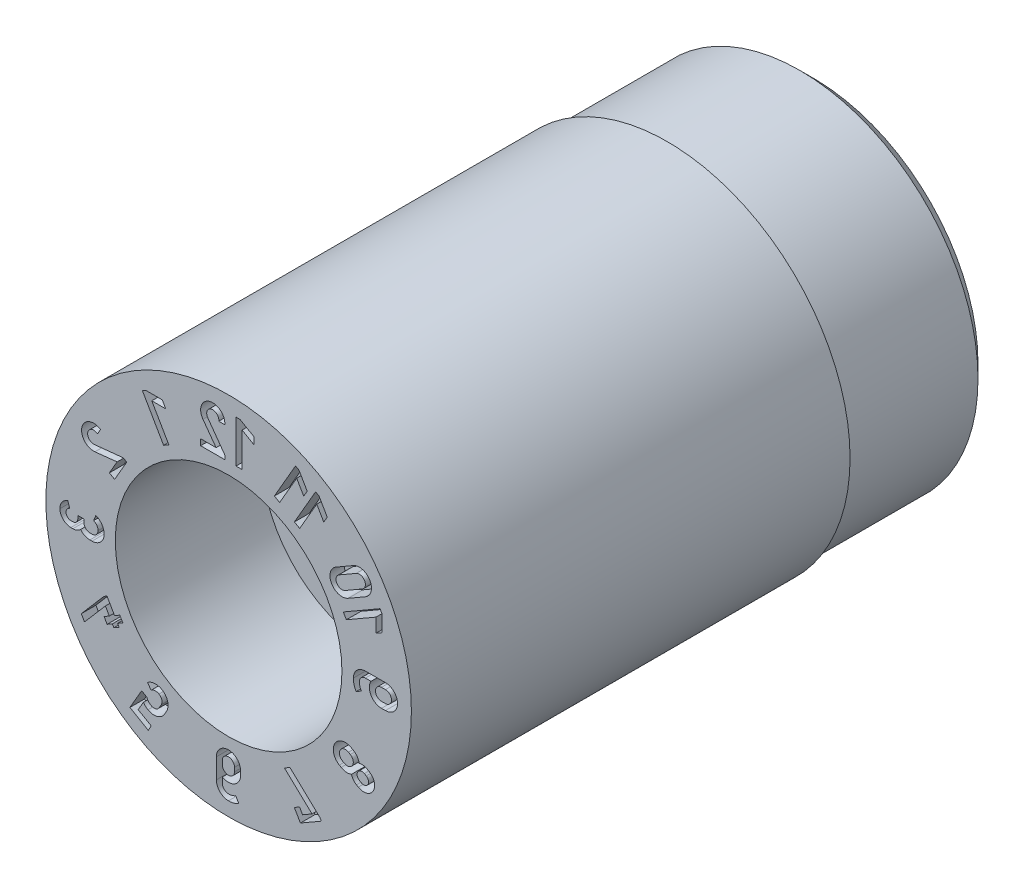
from build123d import *

# Parameters (mm, degrees)
SKETCH4_W          = 2
SKETCH4_H          = 1
CUT_EXTRUDE1_DEPTH = 0.2


with BuildPart() as part:
    # Sketch1 → Revolve1 (revolve)
    with BuildSketch(Plane(origin=(0, 0, 0), x_dir=(0, 0, -1), z_dir=(1, 0, 0)), mode=Mode.PRIVATE) as revolve1_sk:
        Polygon((0, 2.5), (0, 1.55), (2, 1.55), (2, 0.8), (8, 0.8), (8, 2.25), (7.75, 2.5), align=None)
    revolve(revolve1_sk.sketch.rotate(Axis((0, 0, 3.797909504), (0, 0, -1)), 90), axis=Axis((0, 0, 3.797909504), (0, 0, -1)))

    # Sketch4 → Cut-Revolve1 (revolve, cut)
    with BuildSketch(Plane(origin=(0, 0, 0), x_dir=(0, 0, -1), z_dir=(1, 0, 0)), mode=Mode.PRIVATE) as cut_revolve1_sk:
        with Locations((7, 2.935)):
            Rectangle(SKETCH4_W, SKETCH4_H)
    revolve(cut_revolve1_sk.sketch.rotate(Axis((0, 0, 0), (0, 0, -1)), 90), axis=Axis((0, 0, 0), (0, 0, -1)), mode=Mode.SUBTRACT)

    # Sketch2 → Cut-Extrude1 (cut)
    # profile 1 of 15: a face of its own
    with BuildSketch(Plane.XY):
        Polygon((1.189785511, 1.946416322), (1.236985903, 1.919165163), (1.349145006, 1.725678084), (1.30140042, 1.642982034), (1.205586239, 1.80821378), (0.97169688, 1.403105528), (0.900002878, 1.444498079), align=None)
    # profile 2 of 15: a face of its own
    with BuildSketch(Plane.XY):
        Polygon((0.915385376, 2.116117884), (0.962585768, 2.088866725), (1.074744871, 1.895379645), (1.027000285, 1.812683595), (0.931186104, 1.977915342), (0.697296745, 1.572807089), (0.625602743, 1.61419964), align=None)
    # profile 3 of 15: a face of its own
    with BuildSketch(Plane.XY):
        with BuildLine():
            Line((2.144767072, 0.163392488), (1.871541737, 0.163346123))
            ThreePointArc((1.871541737, 0.163346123), (1.754462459, 0.114843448), (1.705943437, -0.002229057))
            ThreePointArc((1.705943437, -0.002229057), (1.715873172, -0.075274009), (1.744983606, -0.142999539))
            Line((1.744983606, -0.142999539), (1.816077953, -0.100273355))
            ThreePointArc((1.816077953, -0.100273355), (1.793827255, -0.050339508), (1.7889851, 0.004112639))
            ThreePointArc((1.7889851, 0.004112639), (1.815273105, 0.058513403), (1.871527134, 0.080558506))
            Line((1.871527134, 0.080558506), (1.947523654, 0.080551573))
            ThreePointArc((1.947523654, 0.080551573), (1.94718892, -0.085293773), (2.090950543, -0.167982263))
            Line((2.090950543, -0.167982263), (2.144654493, -0.167796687))
            ThreePointArc((2.144654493, -0.167796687), (2.31030537, -0.002258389), (2.144767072, 0.163392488))
        make_face()
        with BuildLine():
            Line((2.144767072, 0.080561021), (2.090960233, 0.080561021))
            ThreePointArc((2.090960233, 0.080561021), (2.00816354, -0.002238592), (2.090966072, -0.085032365))
            Line((2.090966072, -0.085032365), (2.144761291, -0.085032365))
            ThreePointArc((2.144761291, -0.085032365), (2.227560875, -0.002238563), (2.144767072, 0.080561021))
        make_face(mode=Mode.SUBTRACT)
    # profile 4 of 15: a face of its own
    with BuildSketch(Plane.XY):
        Polygon((0.763515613, -1.538242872), (0.838361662, -1.495030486), (1.248532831, -1.881560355), (1.268400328, -1.91597187), (0.981584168, -2.081565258), (0.898787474, -1.938157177), (0.970501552, -1.896753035), (1.011894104, -1.968447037), (1.140947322, -1.893938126), align=None)
    # profile 5 of 15: a face of its own
    with BuildSketch(Plane.XY):
        with BuildLine():
            Line((1.705307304, -0.85661671), (1.680233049, -0.842113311))
            ThreePointArc((1.680233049, -0.842113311), (1.45391345, -0.902658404), (1.514639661, -1.128929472))
            Line((1.514639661, -1.128929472), (1.539717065, -1.143407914))
            ThreePointArc((1.539717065, -1.143407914), (1.608311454, -1.164983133), (1.679583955, -1.155448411))
            ThreePointArc((1.679583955, -1.155448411), (1.705355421, -1.207044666), (1.748767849, -1.24501443))
            Line((1.748767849, -1.24501443), (1.773870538, -1.259483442))
            ThreePointArc((1.773870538, -1.259483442), (1.977393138, -1.20494098), (1.922850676, -1.00141838))
            Line((1.922850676, -1.00141838), (1.897809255, -0.986853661))
            ThreePointArc((1.897809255, -0.986853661), (1.843247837, -0.968135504), (1.785676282, -0.971717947))
            ThreePointArc((1.785676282, -0.971717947), (1.758292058, -0.905229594), (1.705307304, -0.85661671))
        make_face()
        with BuildLine():
            Line((1.790155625, -1.173326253), (1.81525798, -1.187792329))
            ThreePointArc((1.81525798, -1.187792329), (1.905733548, -1.163549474), (1.881490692, -1.073073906))
            Line((1.881490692, -1.073073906), (1.856411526, -1.058567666))
            ThreePointArc((1.856411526, -1.058567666), (1.765812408, -1.082765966), (1.790155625, -1.173326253))
        make_face(mode=Mode.SUBTRACT)
        with BuildLine():
            Line((1.55601773, -1.057232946), (1.581132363, -1.071732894))
            ThreePointArc((1.581132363, -1.071732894), (1.694215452, -1.04141854), (1.663901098, -0.928335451))
            Line((1.663901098, -0.928335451), (1.638826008, -0.913804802))
            ThreePointArc((1.638826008, -0.913804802), (1.525737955, -0.944132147), (1.55601773, -1.057232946))
        make_face(mode=Mode.SUBTRACT)
    # profile 6 of 15: a face of its own
    with BuildSketch(Plane.XY):
        Polygon((2.071005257, 1.002372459), (2.098256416, 0.955172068), (2.098645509, 0.73152779), (2.015949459, 0.683783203), (2.015587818, 0.874785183), (1.610479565, 0.640895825), (1.569087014, 0.712589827), align=None)
    # profile 7 of 15: a face of its own
    with BuildSketch(Plane.XY):
        with BuildLine():
            Line((1.705388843, 1.33047051), (1.468770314, 1.193858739))
            ThreePointArc((1.468770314, 1.193858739), (1.408137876, 0.967618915), (1.634381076, 0.906999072))
            Line((1.634381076, 0.906999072), (1.871005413, 1.043614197))
            ThreePointArc((1.871005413, 1.043614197), (1.931625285, 1.269850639), (1.705388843, 1.33047051))
        make_face()
        with BuildLine():
            Line((1.592976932, 0.978713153), (1.829601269, 1.115328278))
            ThreePointArc((1.829601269, 1.115328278), (1.85990272, 1.228414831), (1.746816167, 1.258716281))
            Line((1.746816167, 1.258716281), (1.510163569, 1.122138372))
            ThreePointArc((1.510163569, 1.122138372), (1.4798551, 1.009017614), (1.592976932, 0.978713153))
        make_face(mode=Mode.SUBTRACT)
    # profile 8 of 15: a face of its own
    with BuildSketch(Plane.XY):
        Polygon((0.101613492, 2.286608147), (0.156115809, 2.286608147), (0.349991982, 2.175122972), (0.349991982, 2.079633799), (0.184398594, 2.174821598), (0.184398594, 1.707042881), (0.101613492, 1.707042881), align=None)
    # profile 9 of 15: a face of its own
    with BuildSketch(Plane.XY):
        with BuildLine():
            Line((-0.382458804, 1.705773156), (-0.051272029, 1.705773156))
            Line((-0.051272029, 1.705773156), (-0.051272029, 1.760530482))
            Line((-0.051272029, 1.760530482), (-0.284094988, 2.083765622))
            ThreePointArc((-0.284094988, 2.083765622), (-0.236321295, 2.212681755), (-0.135007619, 2.119745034))
            Line((-0.135007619, 2.119745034), (-0.05173191, 2.119742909))
            ThreePointArc((-0.05173191, 2.119742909), (-0.261870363, 2.291530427), (-0.35138769, 2.03529661))
            Line((-0.35138769, 2.03529661), (-0.171311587, 1.788581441))
            Line((-0.171311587, 1.788581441), (-0.382458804, 1.788581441))
            Line((-0.382458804, 1.788581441), (-0.382458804, 1.705773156))
        make_face()
    # profile 10 of 15: a face of its own
    with BuildSketch(Plane.XY):
        Polygon((-1.178901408, 1.959132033), (-1.131701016, 1.986383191), (-0.908056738, 1.986772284), (-0.860312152, 1.904076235), (-1.051314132, 1.903714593), (-0.817424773, 1.498606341), (-0.889118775, 1.457213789), align=None)
    # profile 11 of 15: a face of its own
    with BuildSketch(Plane.XY):
        with BuildLine():
            Line((0.163306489, -1.871711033), (0.163492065, -1.925414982))
            ThreePointArc((0.163492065, -1.925414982), (0.080803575, -2.069176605), (-0.085041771, -2.068841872))
            Line((-0.085041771, -2.068841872), (-0.085048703, -2.144838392))
            ThreePointArc((-0.085048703, -2.144838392), (-0.0630036, -2.201092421), (-0.008602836, -2.227380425))
            ThreePointArc((-0.008602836, -2.227380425), (0.045845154, -2.222539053), (0.09577566, -2.200291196))
            Line((0.09577566, -2.200291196), (0.138511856, -2.271391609))
            ThreePointArc((0.138511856, -2.271391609), (0.070786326, -2.300502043), (-0.002258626, -2.310431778))
            ThreePointArc((-0.002258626, -2.310431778), (-0.11933113, -2.261912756), (-0.167833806, -2.144833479))
            Line((-0.167833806, -2.144833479), (-0.167880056, -1.871597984))
            ThreePointArc((-0.167880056, -1.871597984), (-0.002230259, -1.706061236), (0.163306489, -1.871711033))
        make_face()
        with BuildLine():
            Line((-0.085048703, -1.871608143), (-0.085048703, -1.925414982))
            ThreePointArc((-0.085048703, -1.925414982), (-0.002249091, -2.008211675), (0.080544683, -1.925409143))
            Line((0.080544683, -1.925409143), (0.080544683, -1.871613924))
            ThreePointArc((0.080544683, -1.871613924), (-0.00224912, -1.788814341), (-0.085048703, -1.871608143))
        make_face(mode=Mode.SUBTRACT)
    # profile 12 of 15: a face of its own
    with BuildSketch(Plane.XY):
        with BuildLine():
            Line((-0.850418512, -1.674551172), (-0.877373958, -1.721100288))
            ThreePointArc((-0.877373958, -1.721100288), (-0.977919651, -1.798165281), (-1.103534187, -1.781750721))
            ThreePointArc((-1.103534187, -1.781750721), (-1.137985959, -1.756862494), (-1.166573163, -1.725412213))
            Line((-1.166573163, -1.725412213), (-1.237312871, -1.847914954))
            Line((-1.237312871, -1.847914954), (-1.058047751, -1.951413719))
            Line((-1.058047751, -1.951413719), (-1.099451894, -2.023127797))
            Line((-1.099451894, -2.023127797), (-1.350411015, -1.878236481))
            Line((-1.350411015, -1.878236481), (-1.189709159, -1.5998927))
            Line((-1.189709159, -1.5998927), (-1.118015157, -1.641285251))
            ThreePointArc((-1.118015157, -1.641285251), (-1.09640669, -1.680826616), (-1.062121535, -1.710066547))
            ThreePointArc((-1.062121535, -1.710066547), (-0.999297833, -1.718342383), (-0.949038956, -1.679750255))
            Line((-0.949038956, -1.679750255), (-0.922111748, -1.633157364))
            ThreePointArc((-0.922111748, -1.633157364), (-0.91382848, -1.57032602), (-0.952425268, -1.520059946))
            ThreePointArc((-0.952425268, -1.520059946), (-1.007061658, -1.507582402), (-1.059262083, -1.527977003))
            Line((-1.059262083, -1.527977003), (-1.110809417, -1.463095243))
            ThreePointArc((-1.110809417, -1.463095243), (-1.01319352, -1.424927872), (-0.91102973, -1.448340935))
            ThreePointArc((-0.91102973, -1.448340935), (-0.833919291, -1.548905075), (-0.850418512, -1.674551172))
        make_face()
    # profile 13 of 15: a face of its own
    with BuildSketch(Plane.XY):
        with BuildLine():
            Line((-2.158495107, -0.150850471), (-2.129528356, -0.150850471))
            ThreePointArc((-2.129528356, -0.150850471), (-2.072961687, -0.139692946), (-2.024868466, -0.10789168))
            ThreePointArc((-2.024868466, -0.10789168), (-1.967910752, -0.151797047), (-1.897708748, -0.16740285))
            Line((-1.897708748, -0.16740285), (-1.868719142, -0.16740285))
            ThreePointArc((-1.868719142, -0.16740285), (-1.751638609, -0.118901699), (-1.703153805, -0.001814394))
            ThreePointArc((-1.703153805, -0.001814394), (-1.734003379, 0.098332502), (-1.81583933, 0.163784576))
            Line((-1.81583933, 0.163784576), (-1.846218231, 0.08678617))
            ThreePointArc((-1.846218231, 0.08678617), (-1.802437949, 0.051774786), (-1.785938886, -0.001800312))
            ThreePointArc((-1.785938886, -0.001800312), (-1.810188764, -0.060344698), (-1.86873315, -0.084594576))
            Line((-1.86873315, -0.084594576), (-1.897712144, -0.084594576))
            ThreePointArc((-1.897712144, -0.084594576), (-1.956243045, -0.060350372), (-1.980487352, -0.001819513))
            Line((-1.980487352, -0.001819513), (-1.980487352, 0.039571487))
            Line((-1.980487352, 0.039571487), (-2.063295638, 0.039571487))
            Line((-2.063295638, 0.039571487), (-2.063295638, -0.001809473))
            ThreePointArc((-2.063295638, -0.001809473), (-2.082694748, -0.048643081), (-2.129528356, -0.068042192))
            Line((-2.129528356, -0.068042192), (-2.15850334, -0.068042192))
            ThreePointArc((-2.15850334, -0.068042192), (-2.205320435, -0.048626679), (-2.224739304, -0.001810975))
            ThreePointArc((-2.224739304, -0.001810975), (-2.210784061, 0.04164494), (-2.174084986, 0.068780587))
            Line((-2.174084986, 0.068780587), (-2.200583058, 0.147231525))
            ThreePointArc((-2.200583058, 0.147231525), (-2.278022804, 0.089913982), (-2.30753777, -0.001797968))
            ThreePointArc((-2.30753777, -0.001797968), (-2.263894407, -0.10720015), (-2.158495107, -0.150850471))
        make_face()
    # profile 14 of 15: a face of its own
    with BuildSketch(Plane.XY):
        Polygon((-2.015260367, -1.100052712), (-1.971410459, -1.17600298), (-1.685345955, -0.843537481), (-1.631712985, -0.936432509), (-1.703406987, -0.97782506), (-1.662014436, -1.049519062), (-1.590320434, -1.008126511), (-1.569618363, -1.04398355), (-1.497924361, -1.002590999), (-1.518626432, -0.96673396), (-1.446912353, -0.925329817), (-1.488304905, -0.853635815), (-1.560018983, -0.895039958), (-1.663517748, -0.715774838), (-1.70543796, -0.739977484), align=None)
    # profile 15 of 15: a face of its own
    with BuildSketch(Plane.XY):
        with BuildLine():
            Line((-1.630647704, 0.760508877), (-1.558933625, 0.719104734))
            Line((-1.558933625, 0.719104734), (-1.393340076, 1.005921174))
            Line((-1.393340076, 1.005921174), (-1.44076032, 1.033299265))
            Line((-1.44076032, 1.033299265), (-1.837101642, 0.993286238))
            ThreePointArc((-1.837101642, 0.993286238), (-1.924855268, 1.099112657), (-1.793718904, 1.140382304))
            Line((-1.793718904, 1.140382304), (-1.752081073, 1.212505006))
            ThreePointArc((-1.752081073, 1.212505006), (-2.005918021, 1.116412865), (-1.828773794, 0.910775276))
            Line((-1.828773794, 0.910775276), (-1.525074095, 0.943367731))
            Line((-1.525074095, 0.943367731), (-1.630647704, 0.760508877))
        make_face()
    extrude(amount=-CUT_EXTRUDE1_DEPTH, mode=Mode.SUBTRACT)


solid = part.part
